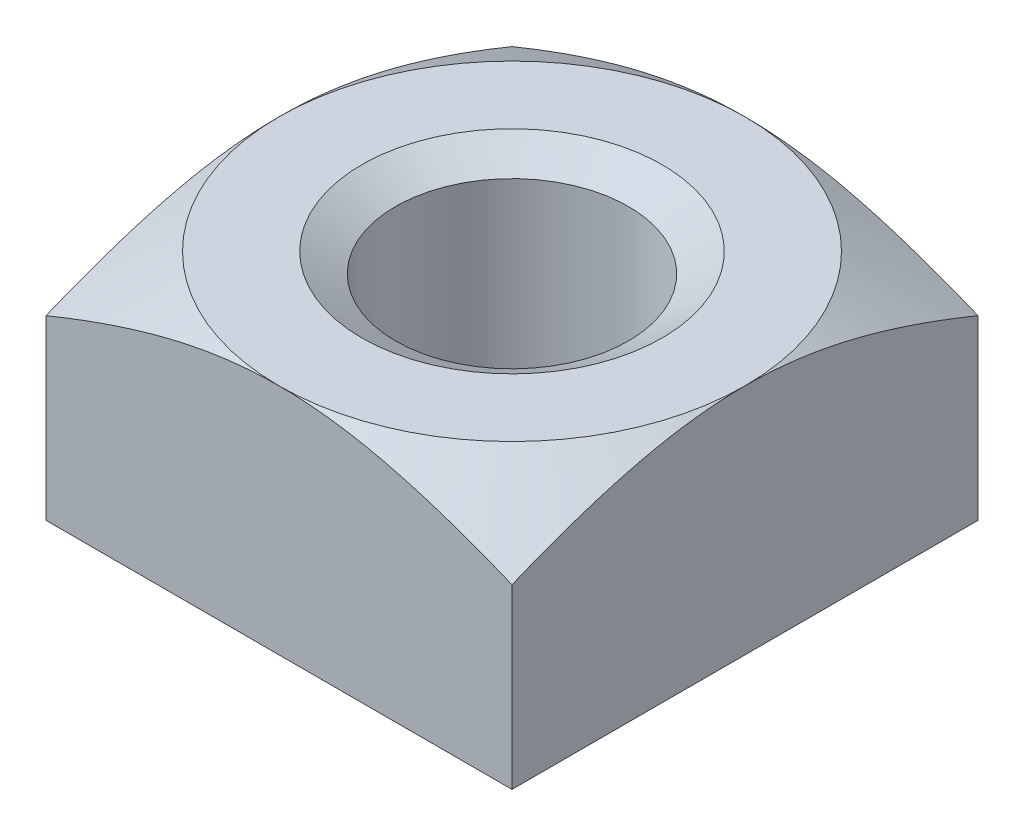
ISO-10303-21;
HEADER;
FILE_DESCRIPTION(('STEP AP214'),'2;1');
FILE_NAME('part.step','',(''),(''),'','','');
FILE_SCHEMA(('AUTOMOTIVE_DESIGN { 1 0 10303 214 1 1 1 1 }'));
ENDSEC;
DATA;
#1=APPLICATION_CONTEXT('core data for automotive mechanical design processes');
#2=APPLICATION_PROTOCOL_DEFINITION('international standard','automotive_design',2000,#1);
#3=PRODUCT_CONTEXT('',#1,'mechanical');
#4=PRODUCT('Part','Part','',(#3));
#5=PRODUCT_RELATED_PRODUCT_CATEGORY('part','',(#4));
#6=PRODUCT_DEFINITION_FORMATION('','',#4);
#7=PRODUCT_DEFINITION_CONTEXT('part definition',#1,'design');
#8=PRODUCT_DEFINITION('design','',#6,#7);
#9=PRODUCT_DEFINITION_SHAPE('','',#8);
#10=(LENGTH_UNIT() NAMED_UNIT(*) SI_UNIT(.MILLI.,.METRE.));
#11=(NAMED_UNIT(*) PLANE_ANGLE_UNIT() SI_UNIT($,.RADIAN.));
#12=(NAMED_UNIT(*) SI_UNIT($,.STERADIAN.) SOLID_ANGLE_UNIT());
#13=UNCERTAINTY_MEASURE_WITH_UNIT(LENGTH_MEASURE(1.E-05),#10,'distance_accuracy_value','');
#14=(GEOMETRIC_REPRESENTATION_CONTEXT(3) GLOBAL_UNCERTAINTY_ASSIGNED_CONTEXT((#13)) GLOBAL_UNIT_ASSIGNED_CONTEXT((#10,
#11,#12)) REPRESENTATION_CONTEXT('',''));
#15=CARTESIAN_POINT('',(0.,0.,0.));
#16=DIRECTION('',(0.,0.,1.));
#17=DIRECTION('',(1.,0.,0.));
#18=AXIS2_PLACEMENT_3D('',#15,#16,#17);
#19=CARTESIAN_POINT('',(-5.,5.,-5.));
#20=DIRECTION('',(1.,0.,0.));
#21=DIRECTION('',(0.,0.,-1.));
#22=AXIS2_PLACEMENT_3D('',#19,#20,#21);
#23=PLANE('',#22);
#24=DIRECTION('',(0.,-1.,0.));
#25=VECTOR('',#24,1.);
#26=CARTESIAN_POINT('',(-5.,5.,5.));
#27=LINE('',#26,#25);
#28=CARTESIAN_POINT('',(-5.,3.80426844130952,5.));
#29=VERTEX_POINT('',#28);
#30=CARTESIAN_POINT('',(-5.,0.,5.));
#31=VERTEX_POINT('',#30);
#32=EDGE_CURVE('E111',#29,#31,#27,.T.);
#33=ORIENTED_EDGE('',*,*,#32,.F.);
#34=CARTESIAN_POINT('',(-5.,1.36900011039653,-10.1214249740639));
#35=CARTESIAN_POINT('',(-5.,1.4961228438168,-9.8758040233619));
#36=CARTESIAN_POINT('',(-5.,1.62255964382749,-9.6298247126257));
#37=CARTESIAN_POINT('',(-5.,1.87369653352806,-9.13696366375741));
#38=CARTESIAN_POINT('',(-5.,1.99839652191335,-8.89008187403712));
#39=CARTESIAN_POINT('',(-5.,2.24594722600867,-8.39472410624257));
#40=CARTESIAN_POINT('',(-5.,2.36879336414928,-8.14624583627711));
#41=CARTESIAN_POINT('',(-5.,2.61183732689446,-7.6480017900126));
#42=CARTESIAN_POINT('',(-5.,2.73203520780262,-7.39823604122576));
#43=CARTESIAN_POINT('',(-5.,2.97585740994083,-6.88285594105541));
#44=CARTESIAN_POINT('',(-5.,3.09928696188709,-6.61714915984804));
#45=CARTESIAN_POINT('',(-5.,3.34134780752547,-6.08353078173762));
#46=CARTESIAN_POINT('',(-5.,3.45997881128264,-5.81561905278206));
#47=CARTESIAN_POINT('',(-5.,3.69082976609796,-5.27728684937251));
#48=CARTESIAN_POINT('',(-5.,3.80305479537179,-5.00686856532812));
#49=CARTESIAN_POINT('',(-5.,4.01907815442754,-4.462705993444));
#50=CARTESIAN_POINT('',(-5.,4.12287774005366,-4.18896220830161));
#51=CARTESIAN_POINT('',(-5.,4.31800695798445,-3.64058863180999));
#52=CARTESIAN_POINT('',(-5.,4.40946721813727,-3.36600591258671));
#53=CARTESIAN_POINT('',(-5.,4.57751060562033,-2.81224297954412));
#54=CARTESIAN_POINT('',(-5.,4.65409306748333,-2.53306256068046));
#55=CARTESIAN_POINT('',(-5.,4.7862349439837,-1.97552264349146));
#56=CARTESIAN_POINT('',(-5.,4.8421850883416,-1.69725891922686));
#57=CARTESIAN_POINT('',(-5.,4.90834152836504,-1.27709653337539));
#58=CARTESIAN_POINT('',(-5.,4.92743249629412,-1.13657732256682));
#59=CARTESIAN_POINT('',(-5.,4.95920143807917,-0.854822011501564));
#60=CARTESIAN_POINT('',(-5.,4.971880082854,-0.713585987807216));
#61=CARTESIAN_POINT('',(-5.,4.99261827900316,-0.397567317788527));
#62=CARTESIAN_POINT('',(-5.,4.99890399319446,-0.222664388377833));
#63=CARTESIAN_POINT('',(-5.,5.00083295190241,0.12720394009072));
#64=CARTESIAN_POINT('',(-5.,4.99647581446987,0.302169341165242));
#65=CARTESIAN_POINT('',(-5.,4.97732601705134,0.651555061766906));
#66=CARTESIAN_POINT('',(-5.,4.96253131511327,0.825975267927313));
#67=CARTESIAN_POINT('',(-5.,4.92316758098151,1.17369985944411));
#68=CARTESIAN_POINT('',(-5.,4.89859820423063,1.34700420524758));
#69=CARTESIAN_POINT('',(-5.,4.83983539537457,1.69703914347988));
#70=CARTESIAN_POINT('',(-5.,4.80538756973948,1.87372656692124));
#71=CARTESIAN_POINT('',(-5.,4.72839980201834,2.22531500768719));
#72=CARTESIAN_POINT('',(-5.,4.68585964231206,2.40021597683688));
#73=CARTESIAN_POINT('',(-5.,4.59387595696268,2.74828217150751));
#74=CARTESIAN_POINT('',(-5.,4.54442861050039,2.92144637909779));
#75=CARTESIAN_POINT('',(-5.,4.4397579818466,3.2659956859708));
#76=CARTESIAN_POINT('',(-5.,4.38453502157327,3.43738088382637));
#77=CARTESIAN_POINT('',(-5.,4.22355480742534,3.91392149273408));
#78=CARTESIAN_POINT('',(-5.,4.11247853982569,4.21727779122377));
#79=CARTESIAN_POINT('',(-5.,3.87926006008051,4.81973261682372));
#80=CARTESIAN_POINT('',(-5.,3.7571147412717,5.11882992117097));
#81=CARTESIAN_POINT('',(-5.,3.5046788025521,5.71387878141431));
#82=CARTESIAN_POINT('',(-5.,3.37438065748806,6.00982712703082));
#83=CARTESIAN_POINT('',(-5.,3.10786527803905,6.59899345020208));
#84=CARTESIAN_POINT('',(-5.,2.97164867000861,6.89221171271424));
#85=CARTESIAN_POINT('',(-5.,2.69431548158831,7.4774440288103));
#86=CARTESIAN_POINT('',(-5.,2.55318484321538,7.76945139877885));
#87=CARTESIAN_POINT('',(-5.,2.26747837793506,8.35177924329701));
#88=CARTESIAN_POINT('',(-5.,2.12290247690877,8.64209968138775));
#89=CARTESIAN_POINT('',(-5.,1.83114555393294,9.22122938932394));
#90=CARTESIAN_POINT('',(-5.,1.68396598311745,9.51003939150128));
#91=CARTESIAN_POINT('',(-5.,1.38747765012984,10.0865652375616));
#92=CARTESIAN_POINT('',(-5.,1.23816887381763,10.3742810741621));
#93=CARTESIAN_POINT('',(-5.,0.82824532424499,11.1585061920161));
#94=CARTESIAN_POINT('',(-5.,0.565934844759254,11.6541286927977));
#95=CARTESIAN_POINT('',(-5.,0.0376846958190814,12.6435268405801));
#96=CARTESIAN_POINT('',(-5.,-0.228255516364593,13.1373021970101));
#97=CARTESIAN_POINT('',(-5.,-0.761013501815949,14.1202021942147));
#98=CARTESIAN_POINT('',(-5.,-1.02781415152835,14.6093361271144));
#99=CARTESIAN_POINT('',(-5.,-1.56336065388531,15.586427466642));
#100=CARTESIAN_POINT('',(-5.,-1.83210615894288,16.0743850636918));
#101=CARTESIAN_POINT('',(-5.,-2.10154754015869,16.5619547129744));
#102=B_SPLINE_CURVE_WITH_KNOTS('',3,(#34,#35,#36,#37,#38,#39,#40,#41,#42,#43,#44,#45,#46,#47,
#48,#49,#50,#51,#52,#53,#54,#55,#56,#57,#58,#59,#60,#61,#62,#63,#64,#65,#66,#67,#68,#69,#70,#71,
#72,#73,#74,#75,#76,#77,#78,#79,#80,#81,#82,#83,#84,#85,#86,#87,#88,#89,#90,#91,#92,#93,#94,#95,
#96,#97,#98,#99,#100,#101),.UNSPECIFIED.,.F.,.F.,(4,2,2,2,2,2,2,2,2,2,2,2,2,2,2,2,2,2,2,2,2,2,2,
2,2,2,2,2,2,2,2,2,2,4),(0.,0.829707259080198,1.65946271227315,2.4910109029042,3.3225413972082,
4.20143297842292,5.08037758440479,5.95861546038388,6.83672219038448,7.70464779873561,
8.57261221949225,9.42317376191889,9.84847820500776,10.2737381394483,10.7984580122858,
11.3231967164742,11.8480381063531,12.372897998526,12.9127205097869,13.4525575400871,
13.9926943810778,14.5328011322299,15.5016170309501,16.4707056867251,17.4407024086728,
18.4105967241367,19.3835401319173,20.3565044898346,21.328942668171,22.301387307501,
23.983634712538,25.666136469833,27.3376309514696,29.0088337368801),.UNSPECIFIED.);
#103=CARTESIAN_POINT('',(-5.00000000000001,5.,0.));
#104=VERTEX_POINT('',#103);
#105=EDGE_CURVE('E94',#29,#104,#102,.F.);
#106=ORIENTED_EDGE('',*,*,#105,.T.);
#107=CARTESIAN_POINT('',(-5.,3.80426844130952,-5.));
#108=VERTEX_POINT('',#107);
#109=EDGE_CURVE('E50',#104,#108,#102,.F.);
#110=ORIENTED_EDGE('',*,*,#109,.T.);
#111=DIRECTION('',(0.,-1.,0.));
#112=VECTOR('',#111,1.);
#113=CARTESIAN_POINT('',(-5.,5.,-5.));
#114=LINE('',#113,#112);
#115=CARTESIAN_POINT('',(-5.,0.,-5.));
#116=VERTEX_POINT('',#115);
#117=EDGE_CURVE('E177',#108,#116,#114,.T.);
#118=ORIENTED_EDGE('',*,*,#117,.T.);
#119=DIRECTION('',(0.,0.,1.));
#120=VECTOR('',#119,1.);
#121=CARTESIAN_POINT('',(-5.,0.,-5.));
#122=LINE('',#121,#120);
#123=EDGE_CURVE('E119',#116,#31,#122,.T.);
#124=ORIENTED_EDGE('',*,*,#123,.T.);
#125=EDGE_LOOP('',(#33,#106,#110,#118,#124));
#126=FACE_BOUND('',#125,.T.);
#127=ADVANCED_FACE('F35',(#126),#23,.F.);
#128=CARTESIAN_POINT('',(-5.,5.,5.));
#129=DIRECTION('',(0.,0.,-1.));
#130=DIRECTION('',(-1.,0.,0.));
#131=AXIS2_PLACEMENT_3D('',#128,#129,#130);
#132=PLANE('',#131);
#133=DIRECTION('',(0.,-1.,0.));
#134=VECTOR('',#133,1.);
#135=CARTESIAN_POINT('',(5.00000000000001,5.,5.));
#136=LINE('',#135,#134);
#137=CARTESIAN_POINT('',(5.00000000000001,3.80426844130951,5.));
#138=VERTEX_POINT('',#137);
#139=CARTESIAN_POINT('',(5.00000000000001,0.,5.));
#140=VERTEX_POINT('',#139);
#141=EDGE_CURVE('E118',#138,#140,#136,.T.);
#142=ORIENTED_EDGE('',*,*,#141,.F.);
#143=CARTESIAN_POINT('',(-10.1214249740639,1.36900011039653,5.));
#144=CARTESIAN_POINT('',(-9.8758040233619,1.4961228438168,5.));
#145=CARTESIAN_POINT('',(-9.6298247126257,1.62255964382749,5.));
#146=CARTESIAN_POINT('',(-9.13696366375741,1.87369653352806,5.));
#147=CARTESIAN_POINT('',(-8.89008187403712,1.99839652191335,5.));
#148=CARTESIAN_POINT('',(-8.39472410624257,2.24594722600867,5.));
#149=CARTESIAN_POINT('',(-8.14624583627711,2.36879336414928,5.));
#150=CARTESIAN_POINT('',(-7.6480017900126,2.61183732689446,5.));
#151=CARTESIAN_POINT('',(-7.39823604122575,2.73203520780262,5.));
#152=CARTESIAN_POINT('',(-6.8828559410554,2.97585740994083,5.));
#153=CARTESIAN_POINT('',(-6.61714915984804,3.09928696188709,5.));
#154=CARTESIAN_POINT('',(-6.08353078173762,3.34134780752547,5.));
#155=CARTESIAN_POINT('',(-5.81561905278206,3.45997881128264,5.));
#156=CARTESIAN_POINT('',(-5.27728684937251,3.69082976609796,5.));
#157=CARTESIAN_POINT('',(-5.00686856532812,3.80305479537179,5.));
#158=CARTESIAN_POINT('',(-4.462705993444,4.01907815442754,5.));
#159=CARTESIAN_POINT('',(-4.18896220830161,4.12287774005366,5.));
#160=CARTESIAN_POINT('',(-3.64058863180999,4.31800695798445,5.));
#161=CARTESIAN_POINT('',(-3.36600591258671,4.40946721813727,5.));
#162=CARTESIAN_POINT('',(-2.81224297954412,4.57751060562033,5.));
#163=CARTESIAN_POINT('',(-2.53306256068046,4.65409306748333,5.));
#164=CARTESIAN_POINT('',(-1.97552264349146,4.7862349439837,5.));
#165=CARTESIAN_POINT('',(-1.69725891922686,4.84218508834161,5.));
#166=CARTESIAN_POINT('',(-1.27709653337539,4.90834152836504,5.));
#167=CARTESIAN_POINT('',(-1.13657732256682,4.92743249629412,5.));
#168=CARTESIAN_POINT('',(-0.854822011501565,4.95920143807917,5.));
#169=CARTESIAN_POINT('',(-0.713585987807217,4.971880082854,5.));
#170=CARTESIAN_POINT('',(-0.397567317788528,4.99261827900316,5.));
#171=CARTESIAN_POINT('',(-0.222664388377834,4.99890399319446,5.));
#172=CARTESIAN_POINT('',(0.127203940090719,5.00083295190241,5.));
#173=CARTESIAN_POINT('',(0.302169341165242,4.99647581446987,5.));
#174=CARTESIAN_POINT('',(0.651555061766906,4.97732601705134,5.));
#175=CARTESIAN_POINT('',(0.825975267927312,4.96253131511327,5.));
#176=CARTESIAN_POINT('',(1.17369985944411,4.92316758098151,5.));
#177=CARTESIAN_POINT('',(1.34700420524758,4.89859820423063,5.));
#178=CARTESIAN_POINT('',(1.69703914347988,4.83983539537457,5.));
#179=CARTESIAN_POINT('',(1.87372656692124,4.80538756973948,5.));
#180=CARTESIAN_POINT('',(2.22531500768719,4.72839980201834,5.));
#181=CARTESIAN_POINT('',(2.40021597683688,4.68585964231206,5.));
#182=CARTESIAN_POINT('',(2.74828217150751,4.59387595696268,5.));
#183=CARTESIAN_POINT('',(2.92144637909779,4.5444286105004,5.));
#184=CARTESIAN_POINT('',(3.2659956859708,4.4397579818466,5.));
#185=CARTESIAN_POINT('',(3.43738088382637,4.38453502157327,5.));
#186=CARTESIAN_POINT('',(3.91392149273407,4.22355480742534,5.));
#187=CARTESIAN_POINT('',(4.21727779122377,4.11247853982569,5.));
#188=CARTESIAN_POINT('',(4.81973261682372,3.87926006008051,5.));
#189=CARTESIAN_POINT('',(5.11882992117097,3.7571147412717,5.));
#190=CARTESIAN_POINT('',(5.71387878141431,3.5046788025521,5.));
#191=CARTESIAN_POINT('',(6.00982712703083,3.37438065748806,5.));
#192=CARTESIAN_POINT('',(6.59899345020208,3.10786527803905,5.));
#193=CARTESIAN_POINT('',(6.89221171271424,2.97164867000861,5.));
#194=CARTESIAN_POINT('',(7.4774440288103,2.69431548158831,5.));
#195=CARTESIAN_POINT('',(7.76945139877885,2.55318484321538,5.));
#196=CARTESIAN_POINT('',(8.35177924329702,2.26747837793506,5.));
#197=CARTESIAN_POINT('',(8.64209968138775,2.12290247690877,5.));
#198=CARTESIAN_POINT('',(9.22122938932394,1.83114555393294,5.));
#199=CARTESIAN_POINT('',(9.51003939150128,1.68396598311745,5.));
#200=CARTESIAN_POINT('',(10.0865652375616,1.38747765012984,5.));
#201=CARTESIAN_POINT('',(10.3742810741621,1.23816887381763,5.));
#202=CARTESIAN_POINT('',(11.1585061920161,0.828245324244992,5.));
#203=CARTESIAN_POINT('',(11.6541286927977,0.565934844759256,5.));
#204=CARTESIAN_POINT('',(12.6435268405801,0.0376846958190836,5.));
#205=CARTESIAN_POINT('',(13.1373021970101,-0.22825551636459,5.));
#206=CARTESIAN_POINT('',(14.1202021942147,-0.761013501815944,5.));
#207=CARTESIAN_POINT('',(14.6093361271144,-1.02781415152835,5.));
#208=CARTESIAN_POINT('',(15.586427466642,-1.5633606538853,5.));
#209=CARTESIAN_POINT('',(16.0743850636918,-1.83210615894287,5.));
#210=CARTESIAN_POINT('',(16.5619547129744,-2.10154754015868,5.));
#211=B_SPLINE_CURVE_WITH_KNOTS('',3,(#143,#144,#145,#146,#147,#148,#149,#150,#151,#152,#153,
#154,#155,#156,#157,#158,#159,#160,#161,#162,#163,#164,#165,#166,#167,#168,#169,#170,#171,#172,
#173,#174,#175,#176,#177,#178,#179,#180,#181,#182,#183,#184,#185,#186,#187,#188,#189,#190,#191,
#192,#193,#194,#195,#196,#197,#198,#199,#200,#201,#202,#203,#204,#205,#206,#207,#208,#209,#210),
.UNSPECIFIED.,.F.,.F.,(4,2,2,2,2,2,2,2,2,2,2,2,2,2,2,2,2,2,2,2,2,2,2,2,2,2,2,2,2,2,2,2,2,4),(0.,
0.829707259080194,1.65946271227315,2.49101090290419,3.3225413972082,4.20143297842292,
5.08037758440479,5.95861546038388,6.83672219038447,7.70464779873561,8.57261221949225,
9.42317376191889,9.84847820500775,10.2737381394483,10.7984580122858,11.3231967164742,
11.8480381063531,12.372897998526,12.9127205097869,13.452557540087,13.9926943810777,
14.5328011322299,15.5016170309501,16.4707056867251,17.4407024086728,18.4105967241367,
19.3835401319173,20.3565044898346,21.328942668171,22.301387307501,23.983634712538,
25.6661364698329,27.3376309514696,29.0088337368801),.UNSPECIFIED.);
#212=CARTESIAN_POINT('',(0.,5.,5.00000000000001));
#213=VERTEX_POINT('',#212);
#214=EDGE_CURVE('E98',#138,#213,#211,.F.);
#215=ORIENTED_EDGE('',*,*,#214,.T.);
#216=EDGE_CURVE('E87',#213,#29,#211,.F.);
#217=ORIENTED_EDGE('',*,*,#216,.T.);
#218=ORIENTED_EDGE('',*,*,#32,.T.);
#219=DIRECTION('',(1.,0.,0.));
#220=VECTOR('',#219,1.);
#221=CARTESIAN_POINT('',(-5.,0.,5.));
#222=LINE('',#221,#220);
#223=EDGE_CURVE('E121',#31,#140,#222,.T.);
#224=ORIENTED_EDGE('',*,*,#223,.T.);
#225=EDGE_LOOP('',(#142,#215,#217,#218,#224));
#226=FACE_BOUND('',#225,.T.);
#227=ADVANCED_FACE('F116',(#226),#132,.F.);
#228=CARTESIAN_POINT('',(5.,5.,-5.));
#229=DIRECTION('',(-1.,0.,0.));
#230=DIRECTION('',(0.,0.,1.));
#231=AXIS2_PLACEMENT_3D('',#228,#229,#230);
#232=PLANE('',#231);
#233=DIRECTION('',(0.,-1.,0.));
#234=VECTOR('',#233,1.);
#235=CARTESIAN_POINT('',(5.,5.,-5.));
#236=LINE('',#235,#234);
#237=CARTESIAN_POINT('',(5.,3.80426844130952,-5.));
#238=VERTEX_POINT('',#237);
#239=CARTESIAN_POINT('',(5.,0.,-5.));
#240=VERTEX_POINT('',#239);
#241=EDGE_CURVE('E175',#238,#240,#236,.T.);
#242=ORIENTED_EDGE('',*,*,#241,.F.);
#243=CARTESIAN_POINT('',(4.99999999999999,1.36900011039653,-10.1214249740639));
#244=CARTESIAN_POINT('',(4.99999999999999,1.4961228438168,-9.8758040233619));
#245=CARTESIAN_POINT('',(4.99999999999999,1.62255964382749,-9.62982471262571));
#246=CARTESIAN_POINT('',(4.99999999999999,1.87369653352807,-9.13696366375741));
#247=CARTESIAN_POINT('',(4.99999999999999,1.99839652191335,-8.89008187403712));
#248=CARTESIAN_POINT('',(4.99999999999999,2.24594722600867,-8.39472410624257));
#249=CARTESIAN_POINT('',(4.99999999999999,2.36879336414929,-8.14624583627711));
#250=CARTESIAN_POINT('',(4.99999999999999,2.61183732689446,-7.6480017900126));
#251=CARTESIAN_POINT('',(4.99999999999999,2.73203520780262,-7.39823604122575));
#252=CARTESIAN_POINT('',(5.,2.97585740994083,-6.8828559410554));
#253=CARTESIAN_POINT('',(5.,3.09928696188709,-6.61714915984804));
#254=CARTESIAN_POINT('',(5.,3.34134780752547,-6.08353078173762));
#255=CARTESIAN_POINT('',(5.,3.45997881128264,-5.81561905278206));
#256=CARTESIAN_POINT('',(5.,3.69082976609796,-5.27728684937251));
#257=CARTESIAN_POINT('',(5.,3.80305479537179,-5.00686856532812));
#258=CARTESIAN_POINT('',(5.,4.01907815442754,-4.462705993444));
#259=CARTESIAN_POINT('',(5.,4.12287774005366,-4.18896220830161));
#260=CARTESIAN_POINT('',(5.,4.31800695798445,-3.64058863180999));
#261=CARTESIAN_POINT('',(5.,4.40946721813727,-3.36600591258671));
#262=CARTESIAN_POINT('',(5.,4.57751060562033,-2.81224297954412));
#263=CARTESIAN_POINT('',(5.,4.65409306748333,-2.53306256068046));
#264=CARTESIAN_POINT('',(5.,4.7862349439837,-1.97552264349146));
#265=CARTESIAN_POINT('',(5.,4.8421850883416,-1.69725891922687));
#266=CARTESIAN_POINT('',(5.,4.90834152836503,-1.27709653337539));
#267=CARTESIAN_POINT('',(5.00000000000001,4.92743249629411,-1.13657732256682));
#268=CARTESIAN_POINT('',(5.00000000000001,4.95920143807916,-0.854822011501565));
#269=CARTESIAN_POINT('',(5.00000000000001,4.97188008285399,-0.713585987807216));
#270=CARTESIAN_POINT('',(5.00000000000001,4.99261827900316,-0.397567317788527));
#271=CARTESIAN_POINT('',(5.00000000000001,4.99890399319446,-0.222664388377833));
#272=CARTESIAN_POINT('',(5.00000000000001,5.00083295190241,0.12720394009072));
#273=CARTESIAN_POINT('',(5.00000000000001,4.99647581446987,0.302169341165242));
#274=CARTESIAN_POINT('',(5.00000000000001,4.97732601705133,0.651555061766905));
#275=CARTESIAN_POINT('',(5.00000000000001,4.96253131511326,0.825975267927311));
#276=CARTESIAN_POINT('',(5.00000000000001,4.92316758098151,1.17369985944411));
#277=CARTESIAN_POINT('',(5.00000000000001,4.89859820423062,1.34700420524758));
#278=CARTESIAN_POINT('',(5.00000000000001,4.83983539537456,1.69703914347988));
#279=CARTESIAN_POINT('',(5.00000000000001,4.80538756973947,1.87372656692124));
#280=CARTESIAN_POINT('',(5.00000000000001,4.72839980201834,2.22531500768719));
#281=CARTESIAN_POINT('',(5.00000000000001,4.68585964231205,2.40021597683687));
#282=CARTESIAN_POINT('',(5.00000000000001,4.59387595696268,2.74828217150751));
#283=CARTESIAN_POINT('',(5.00000000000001,4.54442861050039,2.92144637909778));
#284=CARTESIAN_POINT('',(5.00000000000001,4.4397579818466,3.2659956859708));
#285=CARTESIAN_POINT('',(5.00000000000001,4.38453502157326,3.43738088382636));
#286=CARTESIAN_POINT('',(5.00000000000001,4.22355480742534,3.91392149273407));
#287=CARTESIAN_POINT('',(5.00000000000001,4.11247853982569,4.21727779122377));
#288=CARTESIAN_POINT('',(5.00000000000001,3.87926006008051,4.81973261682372));
#289=CARTESIAN_POINT('',(5.00000000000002,3.7571147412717,5.11882992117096));
#290=CARTESIAN_POINT('',(5.00000000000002,3.50467880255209,5.71387878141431));
#291=CARTESIAN_POINT('',(5.00000000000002,3.37438065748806,6.00982712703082));
#292=CARTESIAN_POINT('',(5.00000000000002,3.10786527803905,6.59899345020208));
#293=CARTESIAN_POINT('',(5.00000000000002,2.9716486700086,6.89221171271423));
#294=CARTESIAN_POINT('',(5.00000000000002,2.69431548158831,7.47744402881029));
#295=CARTESIAN_POINT('',(5.00000000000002,2.55318484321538,7.76945139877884));
#296=CARTESIAN_POINT('',(5.00000000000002,2.26747837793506,8.351779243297));
#297=CARTESIAN_POINT('',(5.00000000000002,2.12290247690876,8.64209968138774));
#298=CARTESIAN_POINT('',(5.00000000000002,1.83114555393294,9.22122938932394));
#299=CARTESIAN_POINT('',(5.00000000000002,1.68396598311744,9.51003939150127));
#300=CARTESIAN_POINT('',(5.00000000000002,1.38747765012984,10.0865652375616));
#301=CARTESIAN_POINT('',(5.00000000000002,1.23816887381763,10.3742810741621));
#302=CARTESIAN_POINT('',(5.00000000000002,0.828245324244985,11.1585061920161));
#303=CARTESIAN_POINT('',(5.00000000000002,0.565934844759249,11.6541286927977));
#304=CARTESIAN_POINT('',(5.00000000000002,0.0376846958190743,12.6435268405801));
#305=CARTESIAN_POINT('',(5.00000000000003,-0.228255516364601,13.1373021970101));
#306=CARTESIAN_POINT('',(5.00000000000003,-0.761013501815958,14.1202021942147));
#307=CARTESIAN_POINT('',(5.00000000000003,-1.02781415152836,14.6093361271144));
#308=CARTESIAN_POINT('',(5.00000000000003,-1.56336065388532,15.586427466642));
#309=CARTESIAN_POINT('',(5.00000000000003,-1.83210615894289,16.0743850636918));
#310=CARTESIAN_POINT('',(5.00000000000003,-2.1015475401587,16.5619547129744));
#311=B_SPLINE_CURVE_WITH_KNOTS('',3,(#243,#244,#245,#246,#247,#248,#249,#250,#251,#252,#253,
#254,#255,#256,#257,#258,#259,#260,#261,#262,#263,#264,#265,#266,#267,#268,#269,#270,#271,#272,
#273,#274,#275,#276,#277,#278,#279,#280,#281,#282,#283,#284,#285,#286,#287,#288,#289,#290,#291,
#292,#293,#294,#295,#296,#297,#298,#299,#300,#301,#302,#303,#304,#305,#306,#307,#308,#309,#310),
.UNSPECIFIED.,.F.,.F.,(4,2,2,2,2,2,2,2,2,2,2,2,2,2,2,2,2,2,2,2,2,2,2,2,2,2,2,2,2,2,2,2,2,4),(0.,
0.829707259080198,1.65946271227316,2.4910109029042,3.3225413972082,4.20143297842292,
5.0803775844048,5.95861546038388,6.83672219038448,7.70464779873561,8.57261221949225,
9.42317376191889,9.84847820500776,10.2737381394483,10.7984580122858,11.3231967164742,
11.8480381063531,12.372897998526,12.9127205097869,13.452557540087,13.9926943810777,
14.5328011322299,15.5016170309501,16.4707056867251,17.4407024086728,18.4105967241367,
19.3835401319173,20.3565044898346,21.328942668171,22.301387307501,23.983634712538,
25.666136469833,27.3376309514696,29.0088337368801),.UNSPECIFIED.);
#312=CARTESIAN_POINT('',(5.00000000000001,5.,0.));
#313=VERTEX_POINT('',#312);
#314=EDGE_CURVE('E192',#238,#313,#311,.T.);
#315=ORIENTED_EDGE('',*,*,#314,.T.);
#316=EDGE_CURVE('E99',#313,#138,#311,.T.);
#317=ORIENTED_EDGE('',*,*,#316,.T.);
#318=ORIENTED_EDGE('',*,*,#141,.T.);
#319=DIRECTION('',(0.,0.,-1.));
#320=VECTOR('',#319,1.);
#321=CARTESIAN_POINT('',(5.,0.,-5.));
#322=LINE('',#321,#320);
#323=EDGE_CURVE('E182',#140,#240,#322,.T.);
#324=ORIENTED_EDGE('',*,*,#323,.T.);
#325=EDGE_LOOP('',(#242,#315,#317,#318,#324));
#326=FACE_BOUND('',#325,.T.);
#327=ADVANCED_FACE('F143',(#326),#232,.F.);
#328=CARTESIAN_POINT('',(-5.,5.,-5.));
#329=DIRECTION('',(0.,0.,1.));
#330=DIRECTION('',(1.,0.,0.));
#331=AXIS2_PLACEMENT_3D('',#328,#329,#330);
#332=PLANE('',#331);
#333=ORIENTED_EDGE('',*,*,#117,.F.);
#334=CARTESIAN_POINT('',(-10.1214249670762,1.36900011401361,-5.));
#335=CARTESIAN_POINT('',(-9.87580401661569,1.49612284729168,-5.));
#336=CARTESIAN_POINT('',(-9.62982470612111,1.6225596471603,-5.));
#337=CARTESIAN_POINT('',(-9.13696365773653,1.87369653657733,-5.));
#338=CARTESIAN_POINT('',(-8.89008186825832,1.99839652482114,-5.));
#339=CARTESIAN_POINT('',(-8.39472410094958,2.24594722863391,-5.));
#340=CARTESIAN_POINT('',(-8.14624583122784,2.36879336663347,-5.));
#341=CARTESIAN_POINT('',(-7.64800178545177,2.61183732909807,-5.));
#342=CARTESIAN_POINT('',(-7.39823603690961,2.73203520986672,-5.));
#343=CARTESIAN_POINT('',(-6.88285593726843,2.97585741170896,-5.));
#344=CARTESIAN_POINT('',(-6.61714915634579,3.09928696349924,-5.));
#345=CARTESIAN_POINT('',(-6.08353077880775,3.34134780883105,-5.));
#346=CARTESIAN_POINT('',(-5.81561905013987,3.45997881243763,-5.));
#347=CARTESIAN_POINT('',(-5.27728684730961,3.69082976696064,-5.));
#348=CARTESIAN_POINT('',(-5.00686856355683,3.80305479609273,-5.));
#349=CARTESIAN_POINT('',(-4.46270599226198,4.01907815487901,-5.));
#350=CARTESIAN_POINT('',(-4.18896220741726,4.12287774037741,-5.));
#351=CARTESIAN_POINT('',(-3.64058863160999,4.31800695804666,-5.));
#352=CARTESIAN_POINT('',(-3.36600591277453,4.40946721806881,-5.));
#353=CARTESIAN_POINT('',(-2.81224298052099,4.57751060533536,-5.));
#354=CARTESIAN_POINT('',(-2.53306256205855,4.65409306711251,-5.));
#355=CARTESIAN_POINT('',(-1.97552264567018,4.78623494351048,-5.));
#356=CARTESIAN_POINT('',(-1.6972589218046,4.84218508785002,-5.));
#357=CARTESIAN_POINT('',(-1.27709653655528,4.90834152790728,-5.));
#358=CARTESIAN_POINT('',(-1.13657732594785,4.92743249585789,-5.));
#359=CARTESIAN_POINT('',(-0.854822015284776,4.95920143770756,-5.));
#360=CARTESIAN_POINT('',(-0.713585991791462,4.97188008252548,-5.));
#361=CARTESIAN_POINT('',(-0.39756732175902,4.99261827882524,-5.));
#362=CARTESIAN_POINT('',(-0.222664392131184,4.9989039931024,-5.));
#363=CARTESIAN_POINT('',(0.127203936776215,5.00083295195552,-5.));
#364=CARTESIAN_POINT('',(0.302169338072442,4.99647581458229,-5.));
#365=CARTESIAN_POINT('',(0.651555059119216,4.97732601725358,-5.));
#366=CARTESIAN_POINT('',(0.825975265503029,4.96253131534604,-5.));
#367=CARTESIAN_POINT('',(1.17369985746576,4.92316758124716,-5.));
#368=CARTESIAN_POINT('',(1.34700420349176,4.89859820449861,-5.));
#369=CARTESIAN_POINT('',(1.69703914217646,4.83983539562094,-5.));
#370=CARTESIAN_POINT('',(1.87372656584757,4.80538756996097,-5.));
#371=CARTESIAN_POINT('',(2.22531500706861,4.72839980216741,-5.));
#372=CARTESIAN_POINT('',(2.40021597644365,4.68585964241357,-5.));
#373=CARTESIAN_POINT('',(2.74828217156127,4.59387595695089,-5.));
#374=CARTESIAN_POINT('',(2.92144637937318,4.54442861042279,-5.));
#375=CARTESIAN_POINT('',(3.265995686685,4.43975798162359,-5.));
#376=CARTESIAN_POINT('',(3.43738088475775,4.38453502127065,-5.));
#377=CARTESIAN_POINT('',(3.91392149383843,4.22355480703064,-5.));
#378=CARTESIAN_POINT('',(4.21727779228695,4.11247853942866,-5.));
#379=CARTESIAN_POINT('',(4.81973261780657,3.87926005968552,-5.));
#380=CARTESIAN_POINT('',(5.11882992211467,3.75711474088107,-5.));
#381=CARTESIAN_POINT('',(5.71387878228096,3.50467880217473,-5.));
#382=CARTESIAN_POINT('',(6.00982712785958,3.37438065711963,-5.));
#383=CARTESIAN_POINT('',(6.5989934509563,3.10786527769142,-5.));
#384=CARTESIAN_POINT('',(6.89221171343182,2.97164866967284,-5.));
#385=CARTESIAN_POINT('',(7.4774440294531,2.6943154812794,-5.));
#386=CARTESIAN_POINT('',(7.76945139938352,2.5531848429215,-5.));
#387=CARTESIAN_POINT('',(8.35177924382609,2.26747837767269,-5.));
#388=CARTESIAN_POINT('',(8.64209968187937,2.12290247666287,-5.));
#389=CARTESIAN_POINT('',(9.22122938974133,1.8311455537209,-5.));
#390=CARTESIAN_POINT('',(9.51003939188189,1.68396598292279,-5.));
#391=CARTESIAN_POINT('',(10.086565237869,1.38747764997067,-5.));
#392=CARTESIAN_POINT('',(10.3742810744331,1.23816887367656,-5.));
#393=CARTESIAN_POINT('',(11.1585061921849,0.828245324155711,-5.));
#394=CARTESIAN_POINT('',(11.654128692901,0.565934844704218,-5.));
#395=CARTESIAN_POINT('',(12.6435268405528,0.0376846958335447,-5.));
#396=CARTESIAN_POINT('',(13.1373021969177,-0.228255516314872,-5.));
#397=CARTESIAN_POINT('',(14.1202021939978,-0.761013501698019,-5.));
#398=CARTESIAN_POINT('',(14.6093361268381,-1.0278141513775,-5.));
#399=CARTESIAN_POINT('',(15.5864274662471,-1.5633606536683,-5.));
#400=CARTESIAN_POINT('',(16.0743850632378,-1.83210615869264,-5.));
#401=CARTESIAN_POINT('',(16.5619547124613,-2.10154753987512,-5.));
#402=B_SPLINE_CURVE_WITH_KNOTS('',3,(#334,#335,#336,#337,#338,#339,#340,#341,#342,#343,#344,
#345,#346,#347,#348,#349,#350,#351,#352,#353,#354,#355,#356,#357,#358,#359,#360,#361,#362,#363,
#364,#365,#366,#367,#368,#369,#370,#371,#372,#373,#374,#375,#376,#377,#378,#379,#380,#381,#382,
#383,#384,#385,#386,#387,#388,#389,#390,#391,#392,#393,#394,#395,#396,#397,#398,#399,#400,#401),
.UNSPECIFIED.,.F.,.F.,(4,2,2,2,2,2,2,2,2,2,2,2,2,2,2,2,2,2,2,2,2,2,2,2,2,2,2,2,2,2,2,2,2,4),(0.,
0.829707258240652,1.659462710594,2.49101090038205,3.32254139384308,4.20143297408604,
5.08037757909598,5.95861545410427,6.83672218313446,7.70464779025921,8.57261220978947,
9.42317375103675,9.84847819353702,10.2737381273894,10.7984580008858,11.3231967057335,
11.8480380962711,12.3728979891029,12.9127205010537,13.4525575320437,13.9926943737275,
14.5328011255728,15.5016170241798,16.4707056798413,17.4407024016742,18.4105967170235,
19.3835401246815,20.3565044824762,21.3289426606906,22.3013872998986,23.9836347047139,
25.6661364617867,27.3376309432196,29.0088337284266),.UNSPECIFIED.);
#403=CARTESIAN_POINT('',(0.,5.,-5.00000000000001));
#404=VERTEX_POINT('',#403);
#405=EDGE_CURVE('E198',#108,#404,#402,.T.);
#406=ORIENTED_EDGE('',*,*,#405,.T.);
#407=EDGE_CURVE('E58',#404,#238,#402,.T.);
#408=ORIENTED_EDGE('',*,*,#407,.T.);
#409=ORIENTED_EDGE('',*,*,#241,.T.);
#410=DIRECTION('',(-1.,0.,0.));
#411=VECTOR('',#410,1.);
#412=CARTESIAN_POINT('',(-5.,0.,-5.));
#413=LINE('',#412,#411);
#414=EDGE_CURVE('E179',#240,#116,#413,.T.);
#415=ORIENTED_EDGE('',*,*,#414,.T.);
#416=EDGE_LOOP('',(#333,#406,#408,#409,#415));
#417=FACE_BOUND('',#416,.T.);
#418=ADVANCED_FACE('F208',(#417),#332,.F.);
#419=CARTESIAN_POINT('',(-5.,0.,-5.));
#420=DIRECTION('',(0.,1.,0.));
#421=DIRECTION('',(0.,0.,1.));
#422=AXIS2_PLACEMENT_3D('',#419,#420,#421);
#423=PLANE('',#422);
#424=CARTESIAN_POINT('',(0.,0.,0.));
#425=DIRECTION('',(0.,1.,0.));
#426=DIRECTION('',(0.,0.,1.));
#427=AXIS2_PLACEMENT_3D('',#424,#425,#426);
#428=CIRCLE('',#427,3.22168783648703);
#429=CARTESIAN_POINT('',(0.,0.,3.22168783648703));
#430=VERTEX_POINT('',#429);
#431=EDGE_CURVE('E114',#430,#430,#428,.T.);
#432=ORIENTED_EDGE('',*,*,#431,.T.);
#433=EDGE_LOOP('',(#432));
#434=FACE_BOUND('',#433,.T.);
#435=ORIENTED_EDGE('',*,*,#123,.F.);
#436=ORIENTED_EDGE('',*,*,#414,.F.);
#437=ORIENTED_EDGE('',*,*,#323,.F.);
#438=ORIENTED_EDGE('',*,*,#223,.F.);
#439=EDGE_LOOP('',(#435,#436,#437,#438));
#440=FACE_BOUND('',#439,.T.);
#441=ADVANCED_FACE('F189',(#434,#440),#423,.F.);
#442=CARTESIAN_POINT('',(0.,5.,0.));
#443=DIRECTION('',(0.,-1.,0.));
#444=DIRECTION('',(0.,0.,-1.));
#445=AXIS2_PLACEMENT_3D('',#442,#443,#444);
#446=CONICAL_SURFACE('',#445,5.00000000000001,1.0471975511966);
#447=ORIENTED_EDGE('',*,*,#316,.F.);
#448=CARTESIAN_POINT('',(0.,5.,0.));
#449=DIRECTION('',(0.,1.,0.));
#450=DIRECTION('',(0.,0.,1.));
#451=AXIS2_PLACEMENT_3D('',#448,#449,#450);
#452=CIRCLE('',#451,5.00000000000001);
#453=EDGE_CURVE('E104',#313,#213,#452,.F.);
#454=ORIENTED_EDGE('',*,*,#453,.T.);
#455=ORIENTED_EDGE('',*,*,#214,.F.);
#456=EDGE_LOOP('',(#447,#454,#455));
#457=FACE_BOUND('',#456,.T.);
#458=ADVANCED_FACE('F105',(#457),#446,.T.);
#459=ORIENTED_EDGE('',*,*,#407,.F.);
#460=CARTESIAN_POINT('',(0.,5.,0.));
#461=DIRECTION('',(0.,-1.,0.));
#462=DIRECTION('',(0.,0.,-1.));
#463=AXIS2_PLACEMENT_3D('',#460,#461,#462);
#464=CIRCLE('',#463,5.00000000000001);
#465=EDGE_CURVE('E202',#404,#313,#464,.T.);
#466=ORIENTED_EDGE('',*,*,#465,.T.);
#467=ORIENTED_EDGE('',*,*,#314,.F.);
#468=EDGE_LOOP('',(#459,#466,#467));
#469=FACE_BOUND('',#468,.T.);
#470=ADVANCED_FACE('F223',(#469),#446,.T.);
#471=EDGE_CURVE('E110',#104,#404,#452,.F.);
#472=ORIENTED_EDGE('',*,*,#471,.T.);
#473=ORIENTED_EDGE('',*,*,#405,.F.);
#474=ORIENTED_EDGE('',*,*,#109,.F.);
#475=EDGE_LOOP('',(#472,#473,#474));
#476=FACE_BOUND('',#475,.T.);
#477=ADVANCED_FACE('F218',(#476),#446,.T.);
#478=EDGE_CURVE('E91',#213,#104,#452,.F.);
#479=ORIENTED_EDGE('',*,*,#478,.T.);
#480=ORIENTED_EDGE('',*,*,#105,.F.);
#481=ORIENTED_EDGE('',*,*,#216,.F.);
#482=EDGE_LOOP('',(#479,#480,#481));
#483=FACE_BOUND('',#482,.T.);
#484=ADVANCED_FACE('F89',(#483),#446,.T.);
#485=CARTESIAN_POINT('',(-5.,5.,-5.));
#486=DIRECTION('',(0.,1.,0.));
#487=DIRECTION('',(0.,0.,1.));
#488=AXIS2_PLACEMENT_3D('',#485,#486,#487);
#489=PLANE('',#488);
#490=CARTESIAN_POINT('',(0.,5.,0.));
#491=DIRECTION('',(0.,1.,0.));
#492=DIRECTION('',(0.,0.,1.));
#493=AXIS2_PLACEMENT_3D('',#490,#491,#492);
#494=CIRCLE('',#493,3.22168783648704);
#495=CARTESIAN_POINT('',(0.,5.,3.22168783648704));
#496=VERTEX_POINT('',#495);
#497=EDGE_CURVE('E11',#496,#496,#494,.F.);
#498=ORIENTED_EDGE('',*,*,#497,.T.);
#499=EDGE_LOOP('',(#498));
#500=FACE_BOUND('',#499,.T.);
#501=ORIENTED_EDGE('',*,*,#478,.F.);
#502=ORIENTED_EDGE('',*,*,#453,.F.);
#503=ORIENTED_EDGE('',*,*,#465,.F.);
#504=ORIENTED_EDGE('',*,*,#471,.F.);
#505=EDGE_LOOP('',(#501,#502,#503,#504));
#506=FACE_BOUND('',#505,.T.);
#507=ADVANCED_FACE('F113',(#500,#506),#489,.T.);
#508=CARTESIAN_POINT('',(0.,0.,0.));
#509=DIRECTION('',(0.,1.,0.));
#510=DIRECTION('',(0.,0.,1.));
#511=AXIS2_PLACEMENT_3D('',#508,#509,#510);
#512=CYLINDRICAL_SURFACE('',#511,2.5);
#513=CARTESIAN_POINT('',(0.,0.416666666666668,0.));
#514=DIRECTION('',(0.,1.,0.));
#515=DIRECTION('',(0.,0.,1.));
#516=AXIS2_PLACEMENT_3D('',#513,#514,#515);
#517=CIRCLE('',#516,2.5);
#518=CARTESIAN_POINT('',(0.,0.416666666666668,2.5));
#519=VERTEX_POINT('',#518);
#520=EDGE_CURVE('E43',#519,#519,#517,.F.);
#521=ORIENTED_EDGE('',*,*,#520,.T.);
#522=EDGE_LOOP('',(#521));
#523=FACE_BOUND('',#522,.T.);
#524=CARTESIAN_POINT('',(0.,4.58333333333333,0.));
#525=DIRECTION('',(0.,1.,0.));
#526=DIRECTION('',(0.,0.,1.));
#527=AXIS2_PLACEMENT_3D('',#524,#525,#526);
#528=CIRCLE('',#527,2.5);
#529=CARTESIAN_POINT('',(0.,4.58333333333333,2.5));
#530=VERTEX_POINT('',#529);
#531=EDGE_CURVE('E165',#530,#530,#528,.T.);
#532=ORIENTED_EDGE('',*,*,#531,.T.);
#533=EDGE_LOOP('',(#532));
#534=FACE_BOUND('',#533,.T.);
#535=ADVANCED_FACE('F151',(#523,#534),#512,.F.);
#536=CARTESIAN_POINT('',(0.,0.,0.));
#537=DIRECTION('',(0.,-1.,0.));
#538=DIRECTION('',(0.,0.,-1.));
#539=AXIS2_PLACEMENT_3D('',#536,#537,#538);
#540=CONICAL_SURFACE('',#539,3.22168783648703,1.0471975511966);
#541=ORIENTED_EDGE('',*,*,#520,.F.);
#542=EDGE_LOOP('',(#541));
#543=FACE_BOUND('',#542,.T.);
#544=ORIENTED_EDGE('',*,*,#431,.F.);
#545=EDGE_LOOP('',(#544));
#546=FACE_BOUND('',#545,.T.);
#547=ADVANCED_FACE('F149',(#543,#546),#540,.F.);
#548=CARTESIAN_POINT('',(0.,4.58333333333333,0.));
#549=DIRECTION('',(0.,1.,0.));
#550=DIRECTION('',(0.,0.,1.));
#551=AXIS2_PLACEMENT_3D('',#548,#549,#550);
#552=CONICAL_SURFACE('',#551,2.5,1.0471975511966);
#553=ORIENTED_EDGE('',*,*,#497,.F.);
#554=EDGE_LOOP('',(#553));
#555=FACE_BOUND('',#554,.T.);
#556=ORIENTED_EDGE('',*,*,#531,.F.);
#557=EDGE_LOOP('',(#556));
#558=FACE_BOUND('',#557,.T.);
#559=ADVANCED_FACE('F37',(#555,#558),#552,.F.);
#560=CLOSED_SHELL('',(#127,#227,#327,#418,#441,#458,#470,#477,#484,#507,#535,#547,#559));
#561=MANIFOLD_SOLID_BREP('B2',#560);
#562=ADVANCED_BREP_SHAPE_REPRESENTATION('',(#18,#561),#14);
#563=SHAPE_DEFINITION_REPRESENTATION(#9,#562);
ENDSEC;
END-ISO-10303-21;
